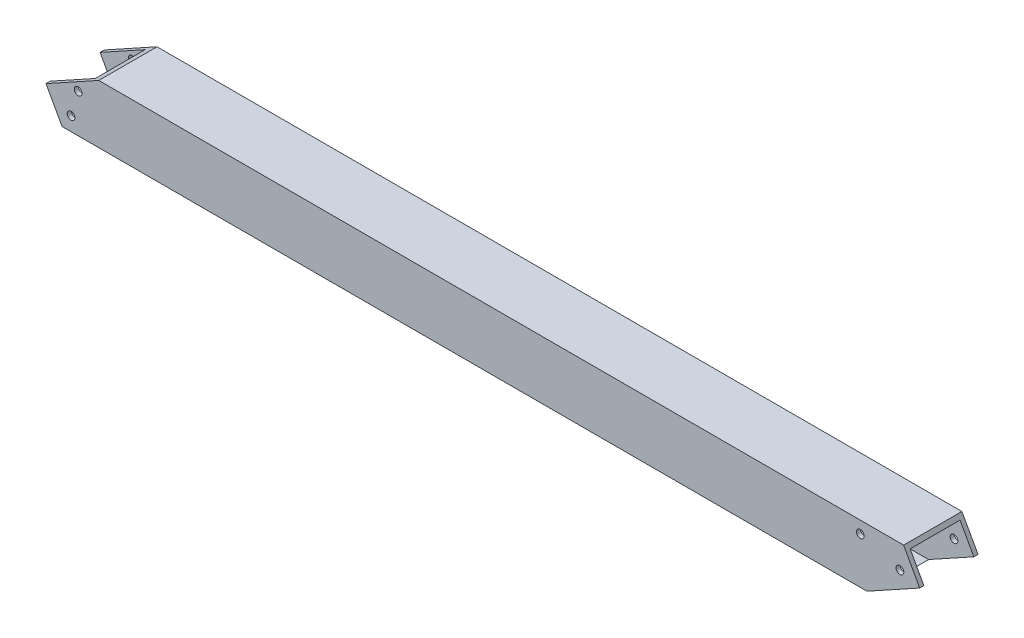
from build123d import *

# Parameters (mm, degrees)
SKETCH1_W          = 50.8
SKETCH1_H          = 50.8
SKETCH1_W_2        = 43.4848
SKETCH1_H_2        = 43.4848
EXTRUDE1_DEPTH     = 3048
SKETCH4_W          = 3184.925707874
SKETCH4_H          = 804.082835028
CUT_EXTRUDE1_DEPTH = 3049.846549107
SKETCH5_R          = 3.37312
CUT_EXTRUDE2_DEPTH = 3049.846549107


with BuildPart() as part:
    # Sketch1 → Extrude1 (new body)
    with BuildSketch(Plane(origin=(0, 0, 0), x_dir=(0, 0, -1), z_dir=(1, 0, 0))):
        with Locations((25.4, 25.4)):
            Rectangle(SKETCH1_W, SKETCH1_H)
        with Locations((25.4, 25.4)):
            Rectangle(SKETCH1_W_2, SKETCH1_H_2, mode=Mode.SUBTRACT)
    extrude(amount=EXTRUDE1_DEPTH)

    # Sketch4 → Cut-Extrude1 (cut, through all)
    with BuildSketch(Plane(origin=(0, 0, -50.8), x_dir=(-1, 0, 0), z_dir=(0, 0, -1))):
        with Locations((-1559.066738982, 8.678772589)):
            Rectangle(SKETCH4_W, SKETCH4_H)
        Polygon((-3048, 25.4), (-2464.37079348, -296.985656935), (-2286.291097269, 25.4), (-2869.920303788, 347.785656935), align=None, mode=Mode.SUBTRACT)
    extrude(amount=-CUT_EXTRUDE1_DEPTH, mode=Mode.SUBTRACT)

    # Sketch5 → Cut-Extrude2 (cut, through all)
    with BuildSketch(Plane.XY):
        with Locations((2996.227722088, 40.328202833)):
            Circle(SKETCH5_R)
        with Locations((3030.742574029, 30.376067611)):
            Circle(SKETCH5_R)
        with Locations((2308.107258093, 12.060534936)):
            Circle(SKETCH5_R)
        with Locations((2314.327342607, 33.632317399)):
            Circle(SKETCH5_R)
    extrude(amount=-CUT_EXTRUDE2_DEPTH, mode=Mode.SUBTRACT)


solid = part.part
